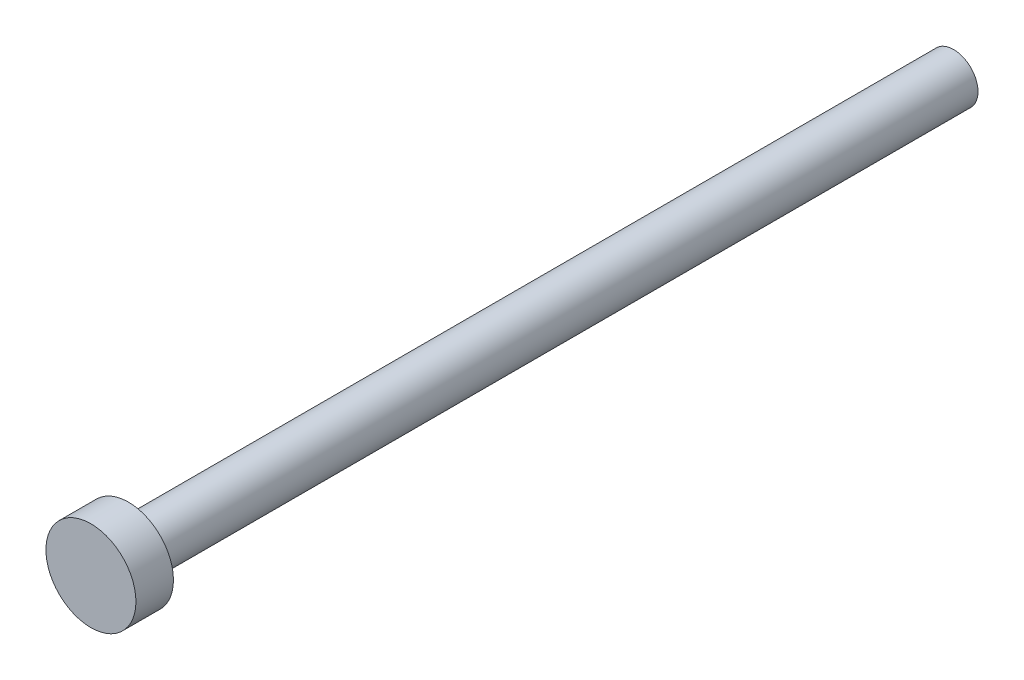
ISO-10303-21;
HEADER;
FILE_DESCRIPTION(('STEP AP214'),'2;1');
FILE_NAME('part.step','',(''),(''),'','','');
FILE_SCHEMA(('AUTOMOTIVE_DESIGN { 1 0 10303 214 1 1 1 1 }'));
ENDSEC;
DATA;
#1=APPLICATION_CONTEXT('core data for automotive mechanical design processes');
#2=APPLICATION_PROTOCOL_DEFINITION('international standard','automotive_design',2000,#1);
#3=PRODUCT_CONTEXT('',#1,'mechanical');
#4=PRODUCT('Part','Part','',(#3));
#5=PRODUCT_RELATED_PRODUCT_CATEGORY('part','',(#4));
#6=PRODUCT_DEFINITION_FORMATION('','',#4);
#7=PRODUCT_DEFINITION_CONTEXT('part definition',#1,'design');
#8=PRODUCT_DEFINITION('design','',#6,#7);
#9=PRODUCT_DEFINITION_SHAPE('','',#8);
#10=(LENGTH_UNIT() NAMED_UNIT(*) SI_UNIT(.MILLI.,.METRE.));
#11=(NAMED_UNIT(*) PLANE_ANGLE_UNIT() SI_UNIT($,.RADIAN.));
#12=(NAMED_UNIT(*) SI_UNIT($,.STERADIAN.) SOLID_ANGLE_UNIT());
#13=UNCERTAINTY_MEASURE_WITH_UNIT(LENGTH_MEASURE(1.E-05),#10,'distance_accuracy_value','');
#14=(GEOMETRIC_REPRESENTATION_CONTEXT(3) GLOBAL_UNCERTAINTY_ASSIGNED_CONTEXT((#13)) GLOBAL_UNIT_ASSIGNED_CONTEXT((#10,
#11,#12)) REPRESENTATION_CONTEXT('',''));
#15=CARTESIAN_POINT('',(0.,0.,0.));
#16=DIRECTION('',(0.,0.,1.));
#17=DIRECTION('',(1.,0.,0.));
#18=AXIS2_PLACEMENT_3D('',#15,#16,#17);
#19=CARTESIAN_POINT('',(0.,0.,0.));
#20=DIRECTION('',(0.,0.,1.));
#21=DIRECTION('',(1.,0.,0.));
#22=AXIS2_PLACEMENT_3D('',#19,#20,#21);
#23=PLANE('',#22);
#24=CARTESIAN_POINT('',(0.,0.,0.));
#25=DIRECTION('',(0.,0.,1.));
#26=DIRECTION('',(1.,0.,0.));
#27=AXIS2_PLACEMENT_3D('',#24,#25,#26);
#28=CIRCLE('',#27,6.);
#29=CARTESIAN_POINT('',(6.,0.,0.));
#30=VERTEX_POINT('',#29);
#31=EDGE_CURVE('E40',#30,#30,#28,.T.);
#32=ORIENTED_EDGE('',*,*,#31,.F.);
#33=EDGE_LOOP('',(#32));
#34=FACE_BOUND('',#33,.T.);
#35=CARTESIAN_POINT('',(0.,0.,0.));
#36=DIRECTION('',(0.,0.,1.));
#37=DIRECTION('',(1.,0.,0.));
#38=AXIS2_PLACEMENT_3D('',#35,#36,#37);
#39=CIRCLE('',#38,3.25);
#40=CARTESIAN_POINT('',(3.25,0.,0.));
#41=VERTEX_POINT('',#40);
#42=EDGE_CURVE('E10',#41,#41,#39,.F.);
#43=ORIENTED_EDGE('',*,*,#42,.F.);
#44=EDGE_LOOP('',(#43));
#45=FACE_BOUND('',#44,.T.);
#46=ADVANCED_FACE('F29',(#34,#45),#23,.F.);
#47=CARTESIAN_POINT('',(0.,0.,5.));
#48=DIRECTION('',(0.,0.,-1.));
#49=DIRECTION('',(-1.,0.,0.));
#50=AXIS2_PLACEMENT_3D('',#47,#48,#49);
#51=CYLINDRICAL_SURFACE('',#50,6.);
#52=CARTESIAN_POINT('',(0.,0.,5.));
#53=DIRECTION('',(0.,0.,1.));
#54=DIRECTION('',(1.,0.,0.));
#55=AXIS2_PLACEMENT_3D('',#52,#53,#54);
#56=CIRCLE('',#55,6.);
#57=CARTESIAN_POINT('',(6.,0.,5.));
#58=VERTEX_POINT('',#57);
#59=EDGE_CURVE('E36',#58,#58,#56,.T.);
#60=ORIENTED_EDGE('',*,*,#59,.F.);
#61=EDGE_LOOP('',(#60));
#62=FACE_BOUND('',#61,.T.);
#63=ORIENTED_EDGE('',*,*,#31,.T.);
#64=EDGE_LOOP('',(#63));
#65=FACE_BOUND('',#64,.T.);
#66=ADVANCED_FACE('F31',(#62,#65),#51,.T.);
#67=CARTESIAN_POINT('',(0.,0.,5.));
#68=DIRECTION('',(0.,0.,1.));
#69=DIRECTION('',(1.,0.,0.));
#70=AXIS2_PLACEMENT_3D('',#67,#68,#69);
#71=PLANE('',#70);
#72=ORIENTED_EDGE('',*,*,#59,.T.);
#73=EDGE_LOOP('',(#72));
#74=FACE_BOUND('',#73,.T.);
#75=ADVANCED_FACE('F54',(#74),#71,.T.);
#76=CARTESIAN_POINT('',(0.,0.,-110.));
#77=DIRECTION('',(0.,0.,1.));
#78=DIRECTION('',(1.,0.,0.));
#79=AXIS2_PLACEMENT_3D('',#76,#77,#78);
#80=CYLINDRICAL_SURFACE('',#79,3.25);
#81=CARTESIAN_POINT('',(0.,0.,-110.));
#82=DIRECTION('',(0.,0.,-1.));
#83=DIRECTION('',(-1.,0.,0.));
#84=AXIS2_PLACEMENT_3D('',#81,#82,#83);
#85=CIRCLE('',#84,3.25);
#86=CARTESIAN_POINT('',(-3.25,0.,-110.));
#87=VERTEX_POINT('',#86);
#88=EDGE_CURVE('E45',#87,#87,#85,.T.);
#89=ORIENTED_EDGE('',*,*,#88,.F.);
#90=EDGE_LOOP('',(#89));
#91=FACE_BOUND('',#90,.T.);
#92=ORIENTED_EDGE('',*,*,#42,.T.);
#93=EDGE_LOOP('',(#92));
#94=FACE_BOUND('',#93,.T.);
#95=ADVANCED_FACE('F52',(#91,#94),#80,.T.);
#96=CARTESIAN_POINT('',(0.,0.,-110.));
#97=DIRECTION('',(0.,0.,-1.));
#98=DIRECTION('',(-1.,0.,0.));
#99=AXIS2_PLACEMENT_3D('',#96,#97,#98);
#100=PLANE('',#99);
#101=ORIENTED_EDGE('',*,*,#88,.T.);
#102=EDGE_LOOP('',(#101));
#103=FACE_BOUND('',#102,.T.);
#104=ADVANCED_FACE('F50',(#103),#100,.T.);
#105=CLOSED_SHELL('',(#46,#66,#75,#95,#104));
#106=MANIFOLD_SOLID_BREP('B2',#105);
#107=ADVANCED_BREP_SHAPE_REPRESENTATION('',(#18,#106),#14);
#108=SHAPE_DEFINITION_REPRESENTATION(#9,#107);
ENDSEC;
END-ISO-10303-21;
